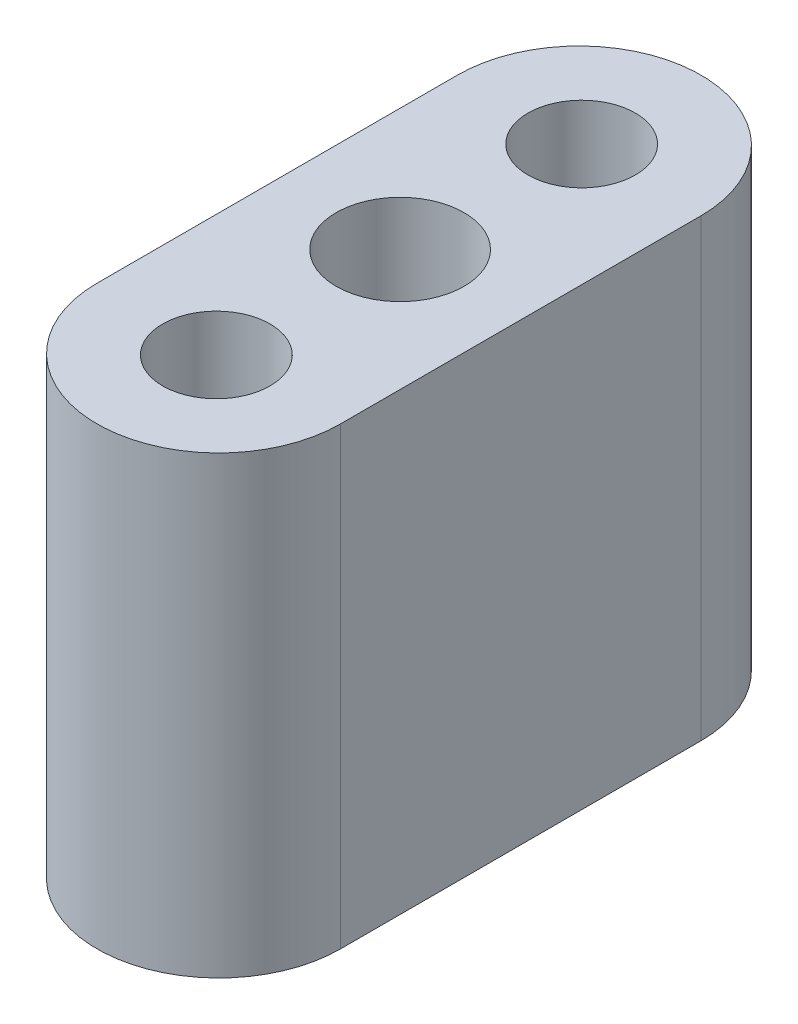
from build123d import *

# Parameters (mm, degrees)
EXTRUDE1_DEPTH               = 17.78
F_5_0_5_DIAMETER_HOLE1_D     = 5
F_5_0_5_DIAMETER_HOLE1_DEPTH = 5.9944
F_5_0_5_DIAMETER_HOLE1_TIP   = 1.502151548
M5X0_8_TAPPED_HOLE2_D        = 4.2
M5X0_8_TAPPED_HOLE2_DEPTH    = 13.9954
M5X0_8_TAPPED_HOLE2_TIP      = 1.2618073


with BuildPart() as part:
    # Sketch1 → Extrude1 (new body)
    with BuildSketch(Plane(origin=(0, 0, 0), x_dir=(1, 0, 0), z_dir=(0, 1, 0))):
        with BuildLine():
            Line((-4.7625, 7.0485), (-4.7625, -7.0485))
            ThreePointArc((-4.7625, -7.0485), (0, -11.811), (4.7625, -7.0485))
            Line((4.7625, -7.0485), (4.7625, 7.0485))
            ThreePointArc((4.7625, 7.0485), (0, 11.811), (-4.7625, 7.0485))
        make_face()
    extrude(amount=EXTRUDE1_DEPTH)

    # 5.0 _5_ Diameter Hole1
    with Locations(Plane(origin=(0.021671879, 17.78, -0.021671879), x_dir=(0, 0, 1), z_dir=(0, 1, 0))):
        with Locations((0, 0)):
            Hole(F_5_0_5_DIAMETER_HOLE1_D / 2, depth=F_5_0_5_DIAMETER_HOLE1_DEPTH)
            with Locations((0, 0, -(F_5_0_5_DIAMETER_HOLE1_DEPTH + F_5_0_5_DIAMETER_HOLE1_TIP / 2))):  # 118° drill point
                Cone(0, F_5_0_5_DIAMETER_HOLE1_D / 2, F_5_0_5_DIAMETER_HOLE1_TIP, mode=Mode.SUBTRACT)

    # M5x0.8 Tapped Hole2
    with Locations(Plane(origin=(0, 17.78, 0), x_dir=(-1, 0, 0), z_dir=(0, 1, 0))):
        with Locations((0, -7.14248), (0, 7.14248)):
            Hole(M5X0_8_TAPPED_HOLE2_D / 2, depth=M5X0_8_TAPPED_HOLE2_DEPTH)
            with Locations((0, 0, -(M5X0_8_TAPPED_HOLE2_DEPTH + M5X0_8_TAPPED_HOLE2_TIP / 2))):  # 118° drill point
                Cone(0, M5X0_8_TAPPED_HOLE2_D / 2, M5X0_8_TAPPED_HOLE2_TIP, mode=Mode.SUBTRACT)


solid = part.part
